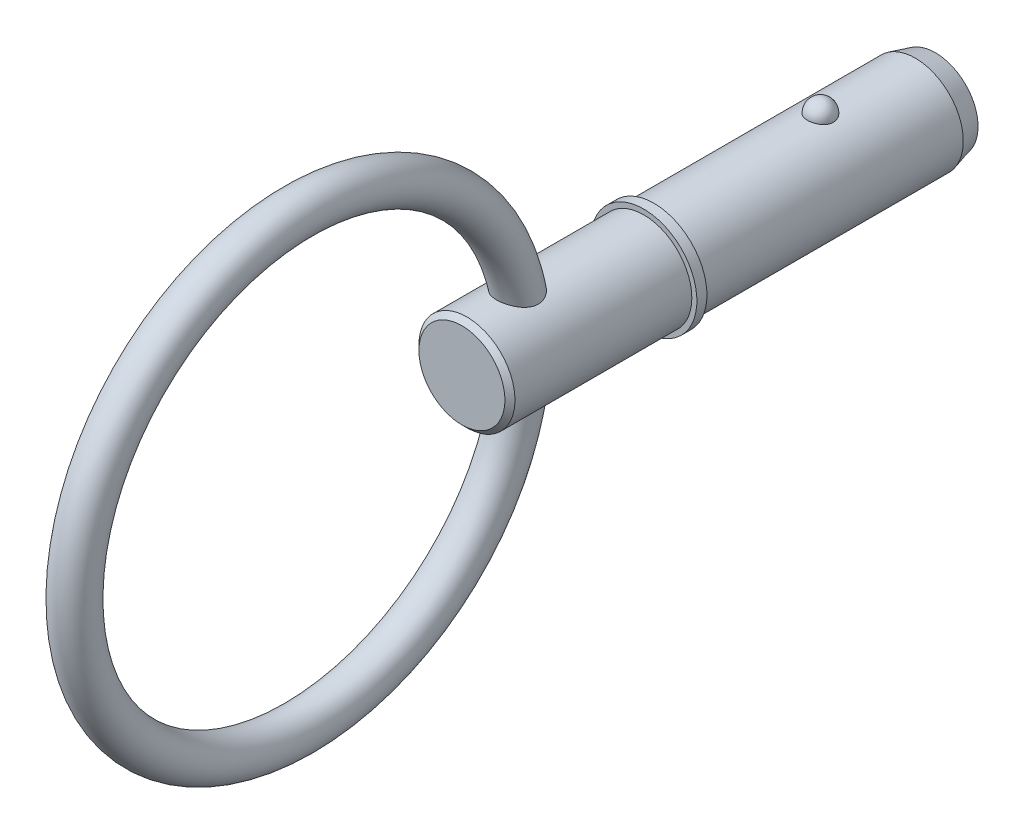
ISO-10303-21;
HEADER;
FILE_DESCRIPTION(('STEP AP214'),'2;1');
FILE_NAME('part.step','',(''),(''),'','','');
FILE_SCHEMA(('AUTOMOTIVE_DESIGN { 1 0 10303 214 1 1 1 1 }'));
ENDSEC;
DATA;
#1=APPLICATION_CONTEXT('core data for automotive mechanical design processes');
#2=APPLICATION_PROTOCOL_DEFINITION('international standard','automotive_design',2000,#1);
#3=PRODUCT_CONTEXT('',#1,'mechanical');
#4=PRODUCT('Part','Part','',(#3));
#5=PRODUCT_RELATED_PRODUCT_CATEGORY('part','',(#4));
#6=PRODUCT_DEFINITION_FORMATION('','',#4);
#7=PRODUCT_DEFINITION_CONTEXT('part definition',#1,'design');
#8=PRODUCT_DEFINITION('design','',#6,#7);
#9=PRODUCT_DEFINITION_SHAPE('','',#8);
#10=(LENGTH_UNIT() NAMED_UNIT(*) SI_UNIT(.MILLI.,.METRE.));
#11=(NAMED_UNIT(*) PLANE_ANGLE_UNIT() SI_UNIT($,.RADIAN.));
#12=(NAMED_UNIT(*) SI_UNIT($,.STERADIAN.) SOLID_ANGLE_UNIT());
#13=UNCERTAINTY_MEASURE_WITH_UNIT(LENGTH_MEASURE(1.E-05),#10,'distance_accuracy_value','');
#14=(GEOMETRIC_REPRESENTATION_CONTEXT(3) GLOBAL_UNCERTAINTY_ASSIGNED_CONTEXT((#13)) GLOBAL_UNIT_ASSIGNED_CONTEXT((#10,
#11,#12)) REPRESENTATION_CONTEXT('',''));
#15=CARTESIAN_POINT('',(0.,0.,0.));
#16=DIRECTION('',(0.,0.,1.));
#17=DIRECTION('',(1.,0.,0.));
#18=AXIS2_PLACEMENT_3D('',#15,#16,#17);
#19=CARTESIAN_POINT('',(0.,0.,15.24));
#20=DIRECTION('',(0.,0.,-1.));
#21=DIRECTION('',(-1.,0.,0.));
#22=AXIS2_PLACEMENT_3D('',#19,#20,#21);
#23=CYLINDRICAL_SURFACE('',#22,4.765);
#24=CARTESIAN_POINT('',(1.27812710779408,4.59038300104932,-1.29));
#25=CARTESIAN_POINT('',(1.27812572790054,4.59038414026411,-1.2178688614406));
#26=CARTESIAN_POINT('',(1.27223018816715,4.59203736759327,-1.14572000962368));
#27=CARTESIAN_POINT('',(1.24878929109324,4.59846646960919,-1.00346315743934));
#28=CARTESIAN_POINT('',(1.23123896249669,4.60324367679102,-0.933356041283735));
#29=CARTESIAN_POINT('',(1.18493861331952,4.61537801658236,-0.797215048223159));
#30=CARTESIAN_POINT('',(1.15619354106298,4.62273400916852,-0.731179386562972));
#31=CARTESIAN_POINT('',(1.08822596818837,4.6392032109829,-0.60498645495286));
#32=CARTESIAN_POINT('',(1.04900384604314,4.64831635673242,-0.544828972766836));
#33=CARTESIAN_POINT('',(0.960865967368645,4.66733302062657,-0.431775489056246));
#34=CARTESIAN_POINT('',(0.911906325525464,4.67723999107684,-0.37891426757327));
#35=CARTESIAN_POINT('',(0.805678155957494,4.69670280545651,-0.282245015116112));
#36=CARTESIAN_POINT('',(0.748409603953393,4.70625864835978,-0.238437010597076));
#37=CARTESIAN_POINT('',(0.627266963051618,4.72392767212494,-0.161207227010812));
#38=CARTESIAN_POINT('',(0.563411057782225,4.73204466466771,-0.127757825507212));
#39=CARTESIAN_POINT('',(0.430755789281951,4.74595788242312,-0.0720471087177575));
#40=CARTESIAN_POINT('',(0.361956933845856,4.75175434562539,-0.0497846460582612));
#41=CARTESIAN_POINT('',(0.222605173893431,4.76030056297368,-0.0173750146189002));
#42=CARTESIAN_POINT('',(0.152101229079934,4.76309991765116,-0.00703038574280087));
#43=CARTESIAN_POINT('',(0.0103009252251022,4.76551622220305,0.00191361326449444));
#44=CARTESIAN_POINT('',(-0.060995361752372,4.76513345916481,0.000514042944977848));
#45=CARTESIAN_POINT('',(-0.201348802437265,4.76125496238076,-0.0138891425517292));
#46=CARTESIAN_POINT('',(-0.270423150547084,4.75780093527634,-0.0267372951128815));
#47=CARTESIAN_POINT('',(-0.405377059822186,4.74820737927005,-0.0634598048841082));
#48=CARTESIAN_POINT('',(-0.4712565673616,4.74206780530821,-0.0873343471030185));
#49=CARTESIAN_POINT('',(-0.598375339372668,4.72771507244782,-0.145611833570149));
#50=CARTESIAN_POINT('',(-0.659587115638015,4.71949070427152,-0.180071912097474));
#51=CARTESIAN_POINT('',(-0.775356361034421,4.70185936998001,-0.258542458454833));
#52=CARTESIAN_POINT('',(-0.829913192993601,4.69245229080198,-0.302553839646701));
#53=CARTESIAN_POINT('',(-0.931895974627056,4.67327936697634,-0.39982907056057));
#54=CARTESIAN_POINT('',(-0.979176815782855,4.66351011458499,-0.453244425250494));
#55=CARTESIAN_POINT('',(-1.06421220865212,4.64484426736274,-0.567321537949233));
#56=CARTESIAN_POINT('',(-1.10196613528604,4.63594772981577,-0.627983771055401));
#57=CARTESIAN_POINT('',(-1.16735225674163,4.61992036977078,-0.755585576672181));
#58=CARTESIAN_POINT('',(-1.19487251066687,4.61280933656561,-0.822585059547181));
#59=CARTESIAN_POINT('',(-1.23851975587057,4.60128324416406,-0.960417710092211));
#60=CARTESIAN_POINT('',(-1.25464705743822,4.59686811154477,-1.03125077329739));
#61=CARTESIAN_POINT('',(-1.27505790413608,4.59124882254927,-1.17443804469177));
#62=CARTESIAN_POINT('',(-1.27938868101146,4.59003186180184,-1.24678501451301));
#63=CARTESIAN_POINT('',(-1.27623192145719,4.5909105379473,-1.3911989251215));
#64=CARTESIAN_POINT('',(-1.26874468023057,4.59300609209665,-1.46326587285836));
#65=CARTESIAN_POINT('',(-1.24220427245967,4.60025423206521,-1.60473192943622));
#66=CARTESIAN_POINT('',(-1.2232043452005,4.60539274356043,-1.67414176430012));
#67=CARTESIAN_POINT('',(-1.1741591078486,4.61813957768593,-1.80870154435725));
#68=CARTESIAN_POINT('',(-1.1441133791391,4.62574799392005,-1.87385132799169));
#69=CARTESIAN_POINT('',(-1.07354327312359,4.64263368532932,-1.99841604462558));
#70=CARTESIAN_POINT('',(-1.03296580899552,4.65191934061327,-2.05779976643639));
#71=CARTESIAN_POINT('',(-0.942433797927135,4.67110036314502,-2.16881966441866));
#72=CARTESIAN_POINT('',(-0.892478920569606,4.68099575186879,-2.22045556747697));
#73=CARTESIAN_POINT('',(-0.784302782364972,4.70033161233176,-2.31471696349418));
#74=CARTESIAN_POINT('',(-0.726054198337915,4.70977043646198,-2.35731146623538));
#75=CARTESIAN_POINT('',(-0.602997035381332,4.72709995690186,-2.43206620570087));
#76=CARTESIAN_POINT('',(-0.538188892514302,4.73499075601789,-2.46422713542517));
#77=CARTESIAN_POINT('',(-0.404639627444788,4.7482563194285,-2.51687454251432));
#78=CARTESIAN_POINT('',(-0.33595386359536,4.7536596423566,-2.53749415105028));
#79=CARTESIAN_POINT('',(-0.195948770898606,4.76148510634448,-2.56703727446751));
#80=CARTESIAN_POINT('',(-0.124629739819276,4.76390758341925,-2.57596210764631));
#81=CARTESIAN_POINT('',(0.017269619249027,4.76548774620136,-2.58180339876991));
#82=CARTESIAN_POINT('',(0.0878407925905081,4.76470225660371,-2.57892886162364));
#83=CARTESIAN_POINT('',(0.227467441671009,4.76008019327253,-2.56172603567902));
#84=CARTESIAN_POINT('',(0.296522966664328,4.75624371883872,-2.54739811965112));
#85=CARTESIAN_POINT('',(0.430942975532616,4.74595041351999,-2.50776251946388));
#86=CARTESIAN_POINT('',(0.496319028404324,4.7395023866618,-2.48249170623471));
#87=CARTESIAN_POINT('',(0.621860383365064,4.72467083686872,-2.4216730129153));
#88=CARTESIAN_POINT('',(0.682025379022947,4.71628720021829,-2.38612452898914));
#89=CARTESIAN_POINT('',(0.796409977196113,4.69833598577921,-2.30511163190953));
#90=CARTESIAN_POINT('',(0.850529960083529,4.68875291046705,-2.25951003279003));
#91=CARTESIAN_POINT('',(0.95041297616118,4.66953243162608,-2.15992428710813));
#92=CARTESIAN_POINT('',(0.996174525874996,4.65989501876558,-2.10593865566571));
#93=CARTESIAN_POINT('',(1.07885962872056,4.64145616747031,-1.99009376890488));
#94=CARTESIAN_POINT('',(1.11562789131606,4.63267081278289,-1.92812106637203));
#95=CARTESIAN_POINT('',(1.17840570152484,4.61710269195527,-1.79873681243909));
#96=CARTESIAN_POINT('',(1.20441973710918,4.61031909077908,-1.73132754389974));
#97=CARTESIAN_POINT('',(1.24242116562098,4.60021170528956,-1.60192906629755));
#98=CARTESIAN_POINT('',(1.25578772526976,4.59655387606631,-1.54036674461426));
#99=CARTESIAN_POINT('',(1.27364121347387,4.59163904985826,-1.41587409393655));
#100=CARTESIAN_POINT('',(1.2781283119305,4.59038200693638,-1.35294379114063));
#101=CARTESIAN_POINT('',(1.27812710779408,4.59038300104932,-1.29));
#102=B_SPLINE_CURVE_WITH_KNOTS('',3,(#24,#25,#26,#27,#28,#29,#30,#31,#32,#33,#34,#35,#36,#37,
#38,#39,#40,#41,#42,#43,#44,#45,#46,#47,#48,#49,#50,#51,#52,#53,#54,#55,#56,#57,#58,#59,#60,#61,
#62,#63,#64,#65,#66,#67,#68,#69,#70,#71,#72,#73,#74,#75,#76,#77,#78,#79,#80,#81,#82,#83,#84,#85,
#86,#87,#88,#89,#90,#91,#92,#93,#94,#95,#96,#97,#98,#99,#100,#101),.UNSPECIFIED.,.T.,.F.,(4,2,2,
2,2,2,2,2,2,2,2,2,2,2,2,2,2,2,2,2,2,2,2,2,2,2,2,2,2,2,2,2,2,2,2,2,2,2,4),(0.,0.216167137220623,
0.432426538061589,0.648590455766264,0.864746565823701,1.0818998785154,1.29905382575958,
1.51562361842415,1.73217119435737,1.94507683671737,2.15796327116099,2.36800220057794,
2.57804465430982,2.78924132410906,3.00045819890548,3.21545551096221,3.43046692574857,
3.64776550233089,3.86505816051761,4.08147951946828,4.29789547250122,4.51331818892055,
4.72874907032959,4.94528769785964,5.1618339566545,5.37911087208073,5.59637335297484,
5.8110751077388,6.02575265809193,6.23664413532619,6.44752874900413,6.65770827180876,
6.86790014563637,7.08116060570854,7.29445887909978,7.51121476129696,7.72788009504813,
7.91651762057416,8.10515153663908),.UNSPECIFIED.);
#103=CARTESIAN_POINT('',(1.27812710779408,4.59038300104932,-1.29));
#104=VERTEX_POINT('',#103);
#105=EDGE_CURVE('E101',#104,#104,#102,.T.);
#106=ORIENTED_EDGE('',*,*,#105,.T.);
#107=EDGE_LOOP('',(#106));
#108=FACE_BOUND('',#107,.T.);
#109=CARTESIAN_POINT('',(0.,0.,-10.7));
#110=DIRECTION('',(0.,0.,-1.));
#111=DIRECTION('',(-1.,0.,0.));
#112=AXIS2_PLACEMENT_3D('',#109,#110,#111);
#113=CIRCLE('',#112,4.765);
#114=CARTESIAN_POINT('',(-4.765,0.,-10.7));
#115=VERTEX_POINT('',#114);
#116=EDGE_CURVE('E108',#115,#115,#113,.F.);
#117=ORIENTED_EDGE('',*,*,#116,.T.);
#118=EDGE_LOOP('',(#117));
#119=FACE_BOUND('',#118,.T.);
#120=CARTESIAN_POINT('',(0.,0.,15.24));
#121=DIRECTION('',(0.,0.,1.));
#122=DIRECTION('',(1.,0.,0.));
#123=AXIS2_PLACEMENT_3D('',#120,#121,#122);
#124=CIRCLE('',#123,4.765);
#125=CARTESIAN_POINT('',(4.765,0.,15.24));
#126=VERTEX_POINT('',#125);
#127=EDGE_CURVE('E106',#126,#126,#124,.T.);
#128=ORIENTED_EDGE('',*,*,#127,.F.);
#129=EDGE_LOOP('',(#128));
#130=FACE_BOUND('',#129,.T.);
#131=ADVANCED_FACE('F39',(#108,#119,#130),#23,.T.);
#132=CARTESIAN_POINT('',(0.,0.,-12.7));
#133=DIRECTION('',(0.,0.,-1.));
#134=DIRECTION('',(-1.,0.,0.));
#135=AXIS2_PLACEMENT_3D('',#132,#133,#134);
#136=PLANE('',#135);
#137=CARTESIAN_POINT('',(0.,0.,-12.7));
#138=DIRECTION('',(0.,0.,-1.));
#139=DIRECTION('',(-1.,0.,0.));
#140=AXIS2_PLACEMENT_3D('',#137,#138,#139);
#141=CIRCLE('',#140,4.22910161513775);
#142=CARTESIAN_POINT('',(-4.22910161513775,0.,-12.7));
#143=VERTEX_POINT('',#142);
#144=EDGE_CURVE('E142',#143,#143,#141,.T.);
#145=ORIENTED_EDGE('',*,*,#144,.T.);
#146=EDGE_LOOP('',(#145));
#147=FACE_BOUND('',#146,.T.);
#148=ADVANCED_FACE('F87',(#147),#136,.T.);
#149=CARTESIAN_POINT('',(0.,0.,-12.7));
#150=DIRECTION('',(0.,0.,1.));
#151=DIRECTION('',(1.,0.,0.));
#152=AXIS2_PLACEMENT_3D('',#149,#150,#151);
#153=CONICAL_SURFACE('',#152,4.22910161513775,0.261799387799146);
#154=ORIENTED_EDGE('',*,*,#116,.F.);
#155=EDGE_LOOP('',(#154));
#156=FACE_BOUND('',#155,.T.);
#157=ORIENTED_EDGE('',*,*,#144,.F.);
#158=EDGE_LOOP('',(#157));
#159=FACE_BOUND('',#158,.T.);
#160=ADVANCED_FACE('F93',(#156,#159),#153,.T.);
#161=CARTESIAN_POINT('',(0.,4.765,-1.29));
#162=DIRECTION('',(0.,1.,0.));
#163=DIRECTION('',(0.,0.,-1.));
#164=AXIS2_PLACEMENT_3D('',#161,#162,#163);
#165=SPHERICAL_SURFACE('',#164,1.29);
#166=ORIENTED_EDGE('',*,*,#105,.F.);
#167=EDGE_LOOP('',(#166));
#168=FACE_BOUND('',#167,.T.);
#169=ADVANCED_FACE('F111',(#168),#165,.T.);
#170=CARTESIAN_POINT('',(0.,0.,15.24));
#171=DIRECTION('',(0.,0.,-1.));
#172=DIRECTION('',(-1.,0.,0.));
#173=AXIS2_PLACEMENT_3D('',#170,#171,#172);
#174=PLANE('',#173);
#175=ORIENTED_EDGE('',*,*,#127,.T.);
#176=EDGE_LOOP('',(#175));
#177=FACE_BOUND('',#176,.T.);
#178=CARTESIAN_POINT('',(0.,0.,15.24));
#179=DIRECTION('',(0.,0.,-1.));
#180=DIRECTION('',(-1.,0.,0.));
#181=AXIS2_PLACEMENT_3D('',#178,#179,#180);
#182=CIRCLE('',#181,5.265);
#183=CARTESIAN_POINT('',(-5.265,0.,15.24));
#184=VERTEX_POINT('',#183);
#185=EDGE_CURVE('E107',#184,#184,#182,.T.);
#186=ORIENTED_EDGE('',*,*,#185,.T.);
#187=EDGE_LOOP('',(#186));
#188=FACE_BOUND('',#187,.T.);
#189=ADVANCED_FACE('F115',(#177,#188),#174,.T.);
#190=CARTESIAN_POINT('',(0.,0.,33.7287874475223));
#191=DIRECTION('',(0.,0.,-1.));
#192=DIRECTION('',(-1.,0.,0.));
#193=AXIS2_PLACEMENT_3D('',#190,#191,#192);
#194=CYLINDRICAL_SURFACE('',#193,5.265);
#195=CARTESIAN_POINT('',(0.,0.,16.24));
#196=DIRECTION('',(0.,0.,-1.));
#197=DIRECTION('',(-1.,0.,0.));
#198=AXIS2_PLACEMENT_3D('',#195,#196,#197);
#199=CIRCLE('',#198,5.265);
#200=CARTESIAN_POINT('',(-5.265,0.,16.24));
#201=VERTEX_POINT('',#200);
#202=EDGE_CURVE('E132',#201,#201,#199,.T.);
#203=ORIENTED_EDGE('',*,*,#202,.T.);
#204=EDGE_LOOP('',(#203));
#205=FACE_BOUND('',#204,.T.);
#206=ORIENTED_EDGE('',*,*,#185,.F.);
#207=EDGE_LOOP('',(#206));
#208=FACE_BOUND('',#207,.T.);
#209=ADVANCED_FACE('F119',(#205,#208),#194,.T.);
#210=CARTESIAN_POINT('',(0.,5.265,16.24));
#211=DIRECTION('',(0.,0.,1.));
#212=DIRECTION('',(1.,0.,0.));
#213=AXIS2_PLACEMENT_3D('',#210,#211,#212);
#214=PLANE('',#213);
#215=CARTESIAN_POINT('',(0.,0.,16.24));
#216=DIRECTION('',(0.,0.,1.));
#217=DIRECTION('',(1.,0.,0.));
#218=AXIS2_PLACEMENT_3D('',#215,#216,#217);
#219=CIRCLE('',#218,4.765);
#220=CARTESIAN_POINT('',(4.765,0.,16.24));
#221=VERTEX_POINT('',#220);
#222=EDGE_CURVE('E110',#221,#221,#219,.T.);
#223=ORIENTED_EDGE('',*,*,#222,.F.);
#224=EDGE_LOOP('',(#223));
#225=FACE_BOUND('',#224,.T.);
#226=ORIENTED_EDGE('',*,*,#202,.F.);
#227=EDGE_LOOP('',(#226));
#228=FACE_BOUND('',#227,.T.);
#229=ADVANCED_FACE('F84',(#225,#228),#214,.T.);
#230=CARTESIAN_POINT('',(0.,0.,34.29));
#231=DIRECTION('',(0.,0.,-1.));
#232=DIRECTION('',(-1.,0.,0.));
#233=AXIS2_PLACEMENT_3D('',#230,#231,#232);
#234=CYLINDRICAL_SURFACE('',#233,4.765);
#235=CARTESIAN_POINT('',(-1.17603588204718,-4.61759294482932,27.1237200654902));
#236=CARTESIAN_POINT('',(-1.08605054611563,-4.6405075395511,27.0615688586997));
#237=CARTESIAN_POINT('',(-0.990486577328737,-4.66202408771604,27.0067393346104));
#238=CARTESIAN_POINT('',(-0.790762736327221,-4.70002969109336,26.9129957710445));
#239=CARTESIAN_POINT('',(-0.686587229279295,-4.7165093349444,26.8741114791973));
#240=CARTESIAN_POINT('',(-0.472539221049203,-4.7427361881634,26.813267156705));
#241=CARTESIAN_POINT('',(-0.362665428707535,-4.75248186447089,26.7913109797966));
#242=CARTESIAN_POINT('',(-0.140482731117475,-4.7642267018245,26.7649366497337));
#243=CARTESIAN_POINT('',(-0.0281752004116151,-4.7662301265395,26.7605088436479));
#244=CARTESIAN_POINT('',(0.193745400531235,-4.76233166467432,26.7692082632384));
#245=CARTESIAN_POINT('',(0.303372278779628,-4.75656024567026,26.7820457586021));
#246=CARTESIAN_POINT('',(0.518724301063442,-4.73791484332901,26.8244340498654));
#247=CARTESIAN_POINT('',(0.624448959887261,-4.72503997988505,26.8539869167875));
#248=CARTESIAN_POINT('',(0.829434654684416,-4.69340588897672,26.9292085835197));
#249=CARTESIAN_POINT('',(0.928674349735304,-4.6746283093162,26.9749277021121));
#250=CARTESIAN_POINT('',(1.11777413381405,-4.63305392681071,27.0814733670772));
#251=CARTESIAN_POINT('',(1.20763216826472,-4.61025624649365,27.1423032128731));
#252=CARTESIAN_POINT('',(1.37762760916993,-4.56238439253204,27.2794393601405));
#253=CARTESIAN_POINT('',(1.45749020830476,-4.53726959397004,27.3560728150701));
#254=CARTESIAN_POINT('',(1.60275140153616,-4.48801828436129,27.5222939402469));
#255=CARTESIAN_POINT('',(1.66815155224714,-4.46388166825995,27.611880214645));
#256=CARTESIAN_POINT('',(1.78162069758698,-4.41980966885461,27.8004689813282));
#257=CARTESIAN_POINT('',(1.82993675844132,-4.3998162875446,27.8993086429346));
#258=CARTESIAN_POINT('',(1.90902953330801,-4.36608532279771,28.1047395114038));
#259=CARTESIAN_POINT('',(1.93981696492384,-4.35234391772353,28.2113259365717));
#260=CARTESIAN_POINT('',(1.9818112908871,-4.33337618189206,28.4223805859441));
#261=CARTESIAN_POINT('',(1.99406945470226,-4.32769391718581,28.52660066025));
#262=CARTESIAN_POINT('',(2.0025484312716,-4.32377679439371,28.7358125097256));
#263=CARTESIAN_POINT('',(1.99876733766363,-4.32554282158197,28.8408043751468));
#264=CARTESIAN_POINT('',(1.97595504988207,-4.33600911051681,29.0491056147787));
#265=CARTESIAN_POINT('',(1.95686739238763,-4.3447350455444,29.1524073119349));
#266=CARTESIAN_POINT('',(1.90457346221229,-4.36790947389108,29.3546792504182));
#267=CARTESIAN_POINT('',(1.87136191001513,-4.38236010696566,29.4536478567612));
#268=CARTESIAN_POINT('',(1.78747856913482,-4.41728816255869,29.6564706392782));
#269=CARTESIAN_POINT('',(1.73524632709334,-4.43826528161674,29.7595927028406));
#270=CARTESIAN_POINT('',(1.61607256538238,-4.48303292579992,29.9563865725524));
#271=CARTESIAN_POINT('',(1.54911576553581,-4.50682636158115,30.0500484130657));
#272=CARTESIAN_POINT('',(1.39359064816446,-4.55746895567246,30.2353838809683));
#273=CARTESIAN_POINT('',(1.30346928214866,-4.58437060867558,30.3257503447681));
#274=CARTESIAN_POINT('',(1.1079439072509,-4.6354985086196,30.4890111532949));
#275=CARTESIAN_POINT('',(1.0025593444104,-4.65972809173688,30.5619274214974));
#276=CARTESIAN_POINT('',(0.803761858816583,-4.69755503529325,30.6724077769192));
#277=CARTESIAN_POINT('',(0.712935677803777,-4.71231838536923,30.7142306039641));
#278=CARTESIAN_POINT('',(0.52517292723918,-4.73691370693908,30.7829362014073));
#279=CARTESIAN_POINT('',(0.428242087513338,-4.7467502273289,30.8098327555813));
#280=CARTESIAN_POINT('',(0.230351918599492,-4.76046566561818,30.8471470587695));
#281=CARTESIAN_POINT('',(0.129376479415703,-4.76431768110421,30.8574904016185));
#282=CARTESIAN_POINT('',(-0.0728965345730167,-4.76551495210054,30.8607168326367));
#283=CARTESIAN_POINT('',(-0.17419408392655,-4.76286070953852,30.8536012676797));
#284=CARTESIAN_POINT('',(-0.366467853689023,-4.751792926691,30.8235798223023));
#285=CARTESIAN_POINT('',(-0.457659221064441,-4.74381187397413,30.8018588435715));
#286=CARTESIAN_POINT('',(-0.635226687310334,-4.72331548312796,30.7450844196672));
#287=CARTESIAN_POINT('',(-0.72160169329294,-4.71079912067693,30.7100279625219));
#288=CARTESIAN_POINT('',(-0.893212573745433,-4.68139468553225,30.6255597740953));
#289=CARTESIAN_POINT('',(-0.978027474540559,-4.66427939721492,30.5753775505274));
#290=CARTESIAN_POINT('',(-1.13917803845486,-4.62756330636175,30.4636420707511));
#291=CARTESIAN_POINT('',(-1.21550961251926,-4.60796131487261,30.4020833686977));
#292=CARTESIAN_POINT('',(-1.37033540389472,-4.56452178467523,30.2586885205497));
#293=CARTESIAN_POINT('',(-1.44723650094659,-4.5405070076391,30.1751843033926));
#294=CARTESIAN_POINT('',(-1.587638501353,-4.49334232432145,29.9972920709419));
#295=CARTESIAN_POINT('',(-1.65112672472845,-4.47019325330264,29.9028938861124));
#296=CARTESIAN_POINT('',(-1.77033243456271,-4.42444393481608,29.6932060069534));
#297=CARTESIAN_POINT('',(-1.82420433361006,-4.40224259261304,29.5767685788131));
#298=CARTESIAN_POINT('',(-1.91169086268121,-4.36496831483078,29.3354090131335));
#299=CARTESIAN_POINT('',(-1.94531523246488,-4.3498919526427,29.2104909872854));
#300=CARTESIAN_POINT('',(-1.98892523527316,-4.33012255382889,28.9620163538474));
#301=CARTESIAN_POINT('',(-1.99998275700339,-4.32495941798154,28.8386899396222));
#302=CARTESIAN_POINT('',(-2.00001713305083,-4.32494814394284,28.5920738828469));
#303=CARTESIAN_POINT('',(-1.98902141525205,-4.33008719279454,28.4687843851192));
#304=CARTESIAN_POINT('',(-1.94752572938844,-4.34888267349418,28.24321378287));
#305=CARTESIAN_POINT('',(-1.91979754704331,-4.36132278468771,28.1403106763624));
#306=CARTESIAN_POINT('',(-1.84805595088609,-4.39220107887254,27.9412512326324));
#307=CARTESIAN_POINT('',(-1.80403476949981,-4.4106421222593,27.8450981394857));
#308=CARTESIAN_POINT('',(-1.70232000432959,-4.4508689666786,27.6644579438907));
#309=CARTESIAN_POINT('',(-1.64499853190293,-4.47255887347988,27.5797380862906));
#310=CARTESIAN_POINT('',(-1.51770958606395,-4.51733419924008,27.4210122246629));
#311=CARTESIAN_POINT('',(-1.44776268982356,-4.54041730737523,27.3469891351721));
#312=CARTESIAN_POINT('',(-1.34143544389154,-4.57239833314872,27.25104340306));
#313=CARTESIAN_POINT('',(-1.30955259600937,-4.58164274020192,27.2241153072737));
#314=CARTESIAN_POINT('',(-1.24406394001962,-4.59985727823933,27.1723409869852));
#315=CARTESIAN_POINT('',(-1.21045807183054,-4.6088273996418,27.1474948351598));
#316=CARTESIAN_POINT('',(-1.17603588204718,-4.61759294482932,27.1237200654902));
#317=B_SPLINE_CURVE_WITH_KNOTS('',3,(#235,#236,#237,#238,#239,#240,#241,#242,#243,#244,#245,
#246,#247,#248,#249,#250,#251,#252,#253,#254,#255,#256,#257,#258,#259,#260,#261,#262,#263,#264,
#265,#266,#267,#268,#269,#270,#271,#272,#273,#274,#275,#276,#277,#278,#279,#280,#281,#282,#283,
#284,#285,#286,#287,#288,#289,#290,#291,#292,#293,#294,#295,#296,#297,#298,#299,#300,#301,#302,
#303,#304,#305,#306,#307,#308,#309,#310,#311,#312,#313,#314,#315,#316),.UNSPECIFIED.,.T.,.F.,(4,
2,2,2,2,2,2,2,2,2,2,2,2,2,2,2,2,2,2,2,2,2,2,2,2,2,2,2,2,2,2,2,2,2,2,2,2,2,2,2,4),(0.,
0.33505479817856,0.670731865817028,1.00648532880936,1.34205386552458,1.6720608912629,
2.00210881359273,2.33319321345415,2.66434996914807,3.00321157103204,3.34203668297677,
3.67573940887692,4.00923787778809,4.32299322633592,4.63678586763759,4.95174139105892,
5.26681474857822,5.6178575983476,5.96926647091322,6.35862694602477,6.747495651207,
7.04947204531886,7.35116911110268,7.65421852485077,7.95724456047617,8.23825252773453,
8.51932400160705,8.81825171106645,9.11732288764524,9.46404422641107,9.81109188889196,
10.1997682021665,10.5882573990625,10.9578189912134,11.32692124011,11.6472091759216,
11.9676500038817,12.2800235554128,12.5918925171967,12.7200569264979,12.8482258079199),.UNSPECIFIED.);
#318=CARTESIAN_POINT('',(-1.17603588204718,-4.61759294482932,27.1237200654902));
#319=VERTEX_POINT('',#318);
#320=EDGE_CURVE('E10',#319,#319,#317,.T.);
#321=ORIENTED_EDGE('',*,*,#320,.F.);
#322=EDGE_LOOP('',(#321));
#323=FACE_BOUND('',#322,.T.);
#324=CARTESIAN_POINT('',(-1.17603588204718,4.61759294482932,27.1237200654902));
#325=CARTESIAN_POINT('',(-1.26499234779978,4.59493450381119,27.1851699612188));
#326=CARTESIAN_POINT('',(-1.34870034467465,4.57085993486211,27.2539152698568));
#327=CARTESIAN_POINT('',(-1.50334626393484,4.52236448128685,27.404635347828));
#328=CARTESIAN_POINT('',(-1.57425996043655,4.49794303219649,27.4866346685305));
#329=CARTESIAN_POINT('',(-1.70130187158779,4.45144771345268,27.6622345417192));
#330=CARTESIAN_POINT('',(-1.75740699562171,4.42937754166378,27.7558528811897));
#331=CARTESIAN_POINT('',(-1.85287755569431,4.3903018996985,27.9521668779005));
#332=CARTESIAN_POINT('',(-1.89225871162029,4.37329167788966,28.0548539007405));
#333=CARTESIAN_POINT('',(-1.95188661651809,4.34699775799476,28.2618576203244));
#334=CARTESIAN_POINT('',(-1.97286468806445,4.33742068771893,28.3659265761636));
#335=CARTESIAN_POINT('',(-1.99814509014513,4.32583397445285,28.5764714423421));
#336=CARTESIAN_POINT('',(-2.00244696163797,4.32382453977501,28.6829474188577));
#337=CARTESIAN_POINT('',(-1.99499900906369,4.32726361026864,28.8927706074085));
#338=CARTESIAN_POINT('',(-1.9836061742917,4.33254625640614,28.996134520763));
#339=CARTESIAN_POINT('',(-1.94643618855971,4.34936983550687,29.1996911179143));
#340=CARTESIAN_POINT('',(-1.92065444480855,4.3609127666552,29.2998827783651));
#341=CARTESIAN_POINT('',(-1.85292379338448,4.3901452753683,29.5041042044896));
#342=CARTESIAN_POINT('',(-1.80971134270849,4.40830066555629,29.6076462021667));
#343=CARTESIAN_POINT('',(-1.70892742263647,4.44833985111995,29.8067684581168));
#344=CARTESIAN_POINT('',(-1.65134284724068,4.47022704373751,29.9023413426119));
#345=CARTESIAN_POINT('',(-1.51475300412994,4.51847764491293,30.0952600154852));
#346=CARTESIAN_POINT('',(-1.43395667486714,4.54505660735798,30.1912914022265));
#347=CARTESIAN_POINT('',(-1.25684082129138,4.59718102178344,30.3681328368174));
#348=CARTESIAN_POINT('',(-1.1605312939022,4.62272712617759,30.4489526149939));
#349=CARTESIAN_POINT('',(-0.972192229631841,4.66558476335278,30.5793265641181));
#350=CARTESIAN_POINT('',(-0.882391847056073,4.68355428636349,30.6318799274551));
#351=CARTESIAN_POINT('',(-0.694836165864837,4.71502283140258,30.7220221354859));
#352=CARTESIAN_POINT('',(-0.597087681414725,4.72852563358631,30.7596236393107));
#353=CARTESIAN_POINT('',(-0.395321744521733,4.74966109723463,30.8178751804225));
#354=CARTESIAN_POINT('',(-0.291269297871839,4.75725698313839,30.8384190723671));
#355=CARTESIAN_POINT('',(-0.0808979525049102,4.76547327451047,30.8606246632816));
#356=CARTESIAN_POINT('',(0.0254198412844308,4.76609700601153,30.8622953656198));
#357=CARTESIAN_POINT('',(0.225327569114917,4.7606097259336,30.8474850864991));
#358=CARTESIAN_POINT('',(0.319084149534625,4.75519734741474,30.8328871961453));
#359=CARTESIAN_POINT('',(0.50275071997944,4.73930039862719,30.7893972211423));
#360=CARTESIAN_POINT('',(0.592660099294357,4.7288150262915,30.760502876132));
#361=CARTESIAN_POINT('',(0.7687773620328,4.70343779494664,30.6890413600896));
#362=CARTESIAN_POINT('',(0.854839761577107,4.68844387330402,30.6461552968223));
#363=CARTESIAN_POINT('',(1.01943666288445,4.65543047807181,30.5487469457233));
#364=CARTESIAN_POINT('',(1.09796821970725,4.63740982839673,30.4942201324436));
#365=CARTESIAN_POINT('',(1.25751825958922,4.59691257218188,30.3664656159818));
#366=CARTESIAN_POINT('',(1.33721103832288,4.57417011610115,30.2916678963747));
#367=CARTESIAN_POINT('',(1.48461190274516,4.52847869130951,30.1310829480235));
#368=CARTESIAN_POINT('',(1.55230949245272,4.50552956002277,30.0452862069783));
#369=CARTESIAN_POINT('',(1.68366050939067,4.45825797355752,29.8514045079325));
#370=CARTESIAN_POINT('',(1.74532014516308,4.43421533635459,29.7418899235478));
#371=CARTESIAN_POINT('',(1.85007805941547,4.39154308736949,29.5132696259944));
#372=CARTESIAN_POINT('',(1.89317429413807,4.37291407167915,29.3941628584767));
#373=CARTESIAN_POINT('',(1.958572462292,4.34402041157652,29.1497631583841));
#374=CARTESIAN_POINT('',(1.98095022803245,4.33372528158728,29.024494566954));
#375=CARTESIAN_POINT('',(2.00301292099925,4.32358016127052,28.7715942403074));
#376=CARTESIAN_POINT('',(2.00273000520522,4.32371536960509,28.6439661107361));
#377=CARTESIAN_POINT('',(1.97997568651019,4.3341693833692,28.4082474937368));
#378=CARTESIAN_POINT('',(1.96044562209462,4.34313814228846,28.2998066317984));
#379=CARTESIAN_POINT('',(1.903681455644,4.36831534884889,28.0885431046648));
#380=CARTESIAN_POINT('',(1.86644884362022,4.38452318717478,27.9857199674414));
#381=CARTESIAN_POINT('',(1.7781154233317,4.42104679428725,27.7947100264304));
#382=CARTESIAN_POINT('',(1.72797707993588,4.44105894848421,27.7060156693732));
#383=CARTESIAN_POINT('',(1.61439500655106,4.48359504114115,27.5382868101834));
#384=CARTESIAN_POINT('',(1.55094927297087,4.50611935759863,27.4592537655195));
#385=CARTESIAN_POINT('',(1.40889349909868,4.55259151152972,27.3087053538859));
#386=CARTESIAN_POINT('',(1.32968750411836,4.57655455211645,27.2377571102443));
#387=CARTESIAN_POINT('',(1.16035884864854,4.62238936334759,27.1095060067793));
#388=CARTESIAN_POINT('',(1.07023361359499,4.64426063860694,27.0522063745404));
#389=CARTESIAN_POINT('',(0.877362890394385,4.68460759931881,26.9503166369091));
#390=CARTESIAN_POINT('',(0.774249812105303,4.70290564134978,26.9063495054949));
#391=CARTESIAN_POINT('',(0.561430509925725,4.73302876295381,26.8354843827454));
#392=CARTESIAN_POINT('',(0.451725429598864,4.74485496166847,26.8085834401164));
#393=CARTESIAN_POINT('',(0.230282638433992,4.76071009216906,26.7727633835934));
#394=CARTESIAN_POINT('',(0.118587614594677,4.76483485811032,26.7636232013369));
#395=CARTESIAN_POINT('',(-0.104911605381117,4.76515532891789,26.7629082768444));
#396=CARTESIAN_POINT('',(-0.216715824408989,4.76134861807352,26.7713388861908));
#397=CARTESIAN_POINT('',(-0.435231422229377,4.74632552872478,26.8052456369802));
#398=CARTESIAN_POINT('',(-0.541996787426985,4.73523460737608,26.8304332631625));
#399=CARTESIAN_POINT('',(-0.749371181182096,4.70686626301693,26.8969215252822));
#400=CARTESIAN_POINT('',(-0.849990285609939,4.68959930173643,26.9381949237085));
#401=CARTESIAN_POINT('',(-0.986108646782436,4.6620261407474,27.0072359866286));
#402=CARTESIAN_POINT('',(-1.02525769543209,4.65355983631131,27.0287724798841));
#403=CARTESIAN_POINT('',(-1.10191286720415,4.63600664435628,27.0743673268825));
#404=CARTESIAN_POINT('',(-1.13941901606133,4.62691976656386,27.098425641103));
#405=CARTESIAN_POINT('',(-1.17603588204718,4.61759294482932,27.1237200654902));
#406=B_SPLINE_CURVE_WITH_KNOTS('',3,(#324,#325,#326,#327,#328,#329,#330,#331,#332,#333,#334,
#335,#336,#337,#338,#339,#340,#341,#342,#343,#344,#345,#346,#347,#348,#349,#350,#351,#352,#353,
#354,#355,#356,#357,#358,#359,#360,#361,#362,#363,#364,#365,#366,#367,#368,#369,#370,#371,#372,
#373,#374,#375,#376,#377,#378,#379,#380,#381,#382,#383,#384,#385,#386,#387,#388,#389,#390,#391,
#392,#393,#394,#395,#396,#397,#398,#399,#400,#401,#402,#403,#404,#405),.UNSPECIFIED.,.T.,.F.,(4,
2,2,2,2,2,2,2,2,2,2,2,2,2,2,2,2,2,2,2,2,2,2,2,2,2,2,2,2,2,2,2,2,2,2,2,2,2,2,2,4),(0.,
0.331234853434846,0.663090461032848,0.995460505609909,1.3275174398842,1.64568783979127,
1.96386699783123,2.27492717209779,2.5860866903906,2.92571998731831,3.26566413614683,
3.64875195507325,4.03159388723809,4.34706664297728,4.66227172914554,4.97942386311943,
5.29642469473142,5.58021908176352,5.86405835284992,6.15488068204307,6.44581627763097,
6.77943874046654,7.11335170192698,7.49545660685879,7.87760356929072,8.25834622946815,
8.63854860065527,8.96843568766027,9.29829501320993,9.6084287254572,9.91860916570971,
10.2441707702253,10.5698092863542,10.9089029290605,11.2479379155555,11.5827251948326,
11.9176144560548,12.2468820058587,12.5755944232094,12.7119417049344,12.8482868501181),.UNSPECIFIED.);
#407=CARTESIAN_POINT('',(-1.17603588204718,4.61759294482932,27.1237200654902));
#408=VERTEX_POINT('',#407);
#409=EDGE_CURVE('E51',#408,#408,#406,.T.);
#410=ORIENTED_EDGE('',*,*,#409,.F.);
#411=EDGE_LOOP('',(#410));
#412=FACE_BOUND('',#411,.T.);
#413=CARTESIAN_POINT('',(0.,0.,33.79));
#414=DIRECTION('',(0.,0.,-1.));
#415=DIRECTION('',(-1.,0.,0.));
#416=AXIS2_PLACEMENT_3D('',#413,#414,#415);
#417=CIRCLE('',#416,4.765);
#418=CARTESIAN_POINT('',(-4.765,0.,33.79));
#419=VERTEX_POINT('',#418);
#420=EDGE_CURVE('E63',#419,#419,#417,.T.);
#421=ORIENTED_EDGE('',*,*,#420,.T.);
#422=EDGE_LOOP('',(#421));
#423=FACE_BOUND('',#422,.T.);
#424=ORIENTED_EDGE('',*,*,#222,.T.);
#425=EDGE_LOOP('',(#424));
#426=FACE_BOUND('',#425,.T.);
#427=ADVANCED_FACE('F68',(#323,#412,#423,#426),#234,.T.);
#428=CARTESIAN_POINT('',(0.,0.,34.29));
#429=DIRECTION('',(0.,0.,-1.));
#430=DIRECTION('',(-1.,0.,0.));
#431=AXIS2_PLACEMENT_3D('',#428,#429,#430);
#432=PLANE('',#431);
#433=CARTESIAN_POINT('',(0.,0.,34.29));
#434=DIRECTION('',(0.,0.,-1.));
#435=DIRECTION('',(-1.,0.,0.));
#436=AXIS2_PLACEMENT_3D('',#433,#434,#435);
#437=CIRCLE('',#436,4.26499999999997);
#438=CARTESIAN_POINT('',(-4.26499999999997,0.,34.29));
#439=VERTEX_POINT('',#438);
#440=EDGE_CURVE('E57',#439,#439,#437,.F.);
#441=ORIENTED_EDGE('',*,*,#440,.T.);
#442=EDGE_LOOP('',(#441));
#443=FACE_BOUND('',#442,.T.);
#444=ADVANCED_FACE('F75',(#443),#432,.F.);
#445=CARTESIAN_POINT('',(0.,0.,33.79));
#446=DIRECTION('',(0.,0.,-1.));
#447=DIRECTION('',(-1.,0.,0.));
#448=AXIS2_PLACEMENT_3D('',#445,#446,#447);
#449=CONICAL_SURFACE('',#448,4.765,0.785398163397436);
#450=ORIENTED_EDGE('',*,*,#440,.F.);
#451=EDGE_LOOP('',(#450));
#452=FACE_BOUND('',#451,.T.);
#453=ORIENTED_EDGE('',*,*,#420,.F.);
#454=EDGE_LOOP('',(#453));
#455=FACE_BOUND('',#454,.T.);
#456=ADVANCED_FACE('F41',(#452,#455),#449,.T.);
#457=CARTESIAN_POINT('',(0.,0.,50.515));
#458=DIRECTION('',(1.,0.,0.));
#459=DIRECTION('',(0.,0.,-1.));
#460=AXIS2_PLACEMENT_3D('',#457,#458,#459);
#461=TOROIDAL_SURFACE('',#460,22.225,2.);
#462=ORIENTED_EDGE('',*,*,#320,.T.);
#463=EDGE_LOOP('',(#462));
#464=FACE_BOUND('',#463,.T.);
#465=ORIENTED_EDGE('',*,*,#409,.T.);
#466=EDGE_LOOP('',(#465));
#467=FACE_BOUND('',#466,.T.);
#468=ADVANCED_FACE('F72',(#464,#467),#461,.T.);
#469=CLOSED_SHELL('',(#131,#148,#160,#169,#189,#209,#229,#427,#444,#456,#468));
#470=MANIFOLD_SOLID_BREP('B2',#469);
#471=ADVANCED_BREP_SHAPE_REPRESENTATION('',(#18,#470),#14);
#472=SHAPE_DEFINITION_REPRESENTATION(#9,#471);
ENDSEC;
END-ISO-10303-21;
